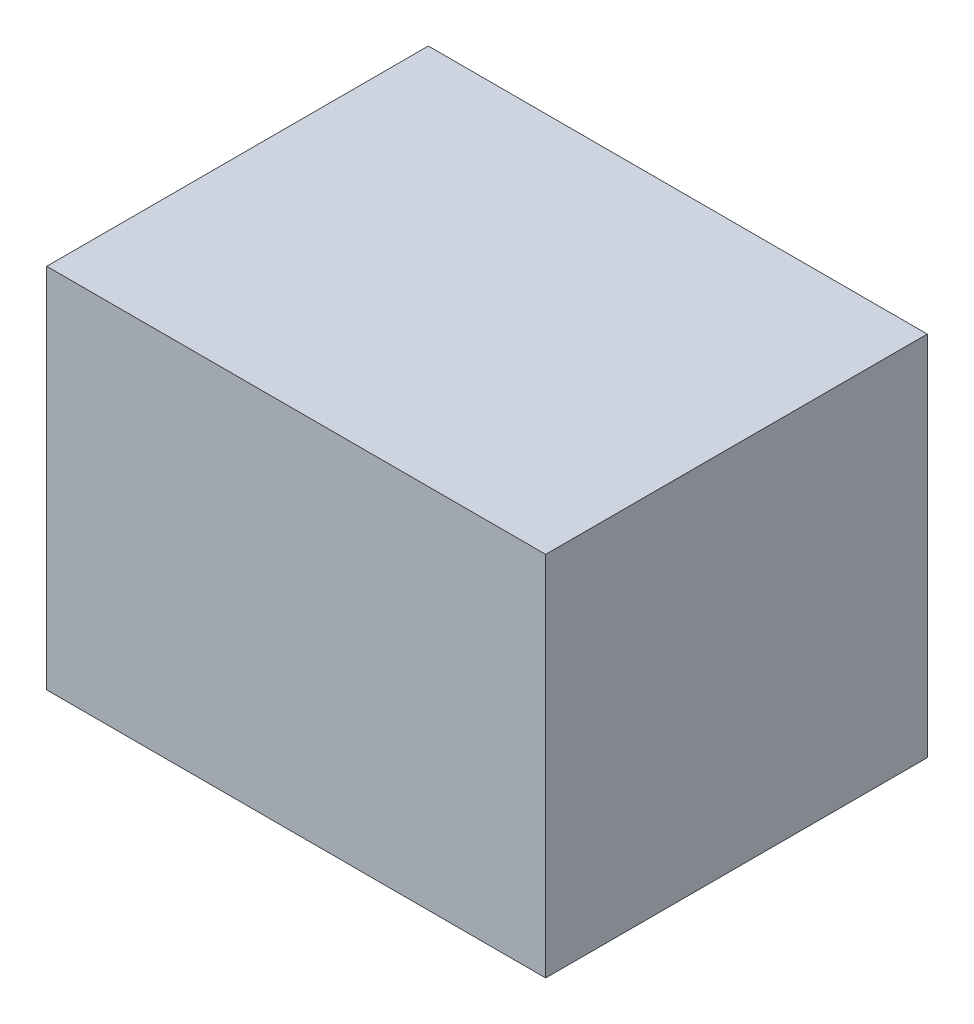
from build123d import *

# Parameters (mm, degrees)
SKETCH_1_W      = 68
SKETCH_1_H      = 52
EXTRUDE_1_DEPTH = 50


with BuildPart() as part:
    # Sketch 1 → Extrude 1 (new body)
    with BuildSketch(Plane(origin=(0, 0, 0), x_dir=(1, 0, 0), z_dir=(0, 1, 0))):
        with Locations((-34, -26)):
            Rectangle(SKETCH_1_W, SKETCH_1_H)
    extrude(amount=EXTRUDE_1_DEPTH)


solid = part.part
